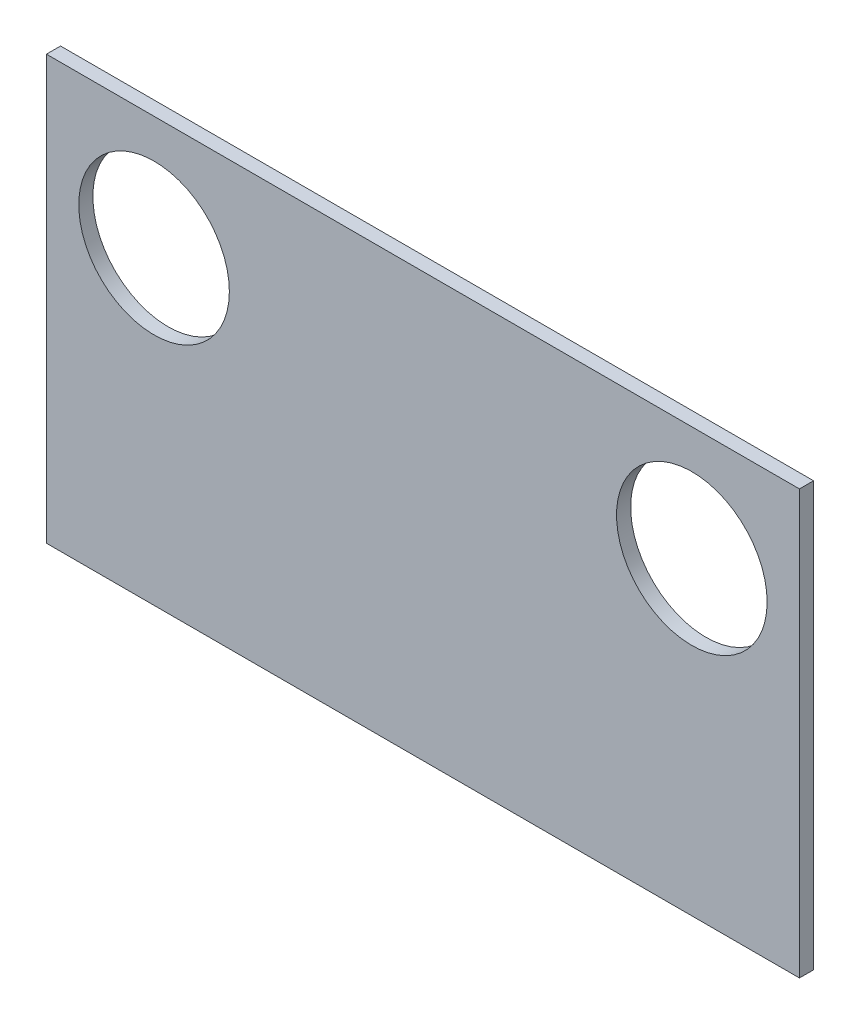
ISO-10303-21;
HEADER;
FILE_DESCRIPTION(('STEP AP214'),'2;1');
FILE_NAME('part.step','',(''),(''),'','','');
FILE_SCHEMA(('AUTOMOTIVE_DESIGN { 1 0 10303 214 1 1 1 1 }'));
ENDSEC;
DATA;
#1=APPLICATION_CONTEXT('core data for automotive mechanical design processes');
#2=APPLICATION_PROTOCOL_DEFINITION('international standard','automotive_design',2000,#1);
#3=PRODUCT_CONTEXT('',#1,'mechanical');
#4=PRODUCT('Part','Part','',(#3));
#5=PRODUCT_RELATED_PRODUCT_CATEGORY('part','',(#4));
#6=PRODUCT_DEFINITION_FORMATION('','',#4);
#7=PRODUCT_DEFINITION_CONTEXT('part definition',#1,'design');
#8=PRODUCT_DEFINITION('design','',#6,#7);
#9=PRODUCT_DEFINITION_SHAPE('','',#8);
#10=(LENGTH_UNIT() NAMED_UNIT(*) SI_UNIT(.MILLI.,.METRE.));
#11=(NAMED_UNIT(*) PLANE_ANGLE_UNIT() SI_UNIT($,.RADIAN.));
#12=(NAMED_UNIT(*) SI_UNIT($,.STERADIAN.) SOLID_ANGLE_UNIT());
#13=UNCERTAINTY_MEASURE_WITH_UNIT(LENGTH_MEASURE(1.E-05),#10,'distance_accuracy_value','');
#14=(GEOMETRIC_REPRESENTATION_CONTEXT(3) GLOBAL_UNCERTAINTY_ASSIGNED_CONTEXT((#13)) GLOBAL_UNIT_ASSIGNED_CONTEXT((#10,
#11,#12)) REPRESENTATION_CONTEXT('',''));
#15=CARTESIAN_POINT('',(0.,0.,0.));
#16=DIRECTION('',(0.,0.,1.));
#17=DIRECTION('',(1.,0.,0.));
#18=AXIS2_PLACEMENT_3D('',#15,#16,#17);
#19=CARTESIAN_POINT('',(0.,0.,0.95));
#20=DIRECTION('',(0.,0.,1.));
#21=DIRECTION('',(1.,0.,0.));
#22=AXIS2_PLACEMENT_3D('',#19,#20,#21);
#23=PLANE('',#22);
#24=CARTESIAN_POINT('',(-5.71341019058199,18.1206220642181,0.95));
#25=DIRECTION('',(0.,0.,1.));
#26=DIRECTION('',(1.,0.,0.));
#27=AXIS2_PLACEMENT_3D('',#24,#25,#26);
#28=CIRCLE('',#27,1.6);
#29=CARTESIAN_POINT('',(-4.11341019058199,18.1206220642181,0.95));
#30=VERTEX_POINT('',#29);
#31=EDGE_CURVE('E102',#30,#30,#28,.T.);
#32=ORIENTED_EDGE('',*,*,#31,.F.);
#33=EDGE_LOOP('',(#32));
#34=FACE_BOUND('',#33,.T.);
#35=DIRECTION('',(0.,-1.,0.));
#36=VECTOR('',#35,1.);
#37=CARTESIAN_POINT('',(-8.,20.5449940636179,0.95));
#38=LINE('',#37,#36);
#39=CARTESIAN_POINT('',(-8.,20.5449940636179,0.95));
#40=VERTEX_POINT('',#39);
#41=CARTESIAN_POINT('',(-8.,11.544994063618,0.95));
#42=VERTEX_POINT('',#41);
#43=EDGE_CURVE('E87',#40,#42,#38,.T.);
#44=ORIENTED_EDGE('',*,*,#43,.T.);
#45=DIRECTION('',(1.,0.,0.));
#46=VECTOR('',#45,1.);
#47=CARTESIAN_POINT('',(-8.,11.544994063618,0.95));
#48=LINE('',#47,#46);
#49=CARTESIAN_POINT('',(8.,11.544994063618,0.95));
#50=VERTEX_POINT('',#49);
#51=EDGE_CURVE('E82',#42,#50,#48,.T.);
#52=ORIENTED_EDGE('',*,*,#51,.T.);
#53=DIRECTION('',(0.,1.,0.));
#54=VECTOR('',#53,1.);
#55=CARTESIAN_POINT('',(8.,20.5449940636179,0.95));
#56=LINE('',#55,#54);
#57=CARTESIAN_POINT('',(8.,20.5449940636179,0.95));
#58=VERTEX_POINT('',#57);
#59=EDGE_CURVE('E85',#50,#58,#56,.T.);
#60=ORIENTED_EDGE('',*,*,#59,.T.);
#61=DIRECTION('',(-1.,0.,0.));
#62=VECTOR('',#61,1.);
#63=CARTESIAN_POINT('',(-8.,20.5449940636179,0.95));
#64=LINE('',#63,#62);
#65=EDGE_CURVE('E52',#58,#40,#64,.T.);
#66=ORIENTED_EDGE('',*,*,#65,.T.);
#67=EDGE_LOOP('',(#44,#52,#60,#66));
#68=FACE_BOUND('',#67,.T.);
#69=CARTESIAN_POINT('',(5.7134101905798,18.1206220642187,0.95));
#70=DIRECTION('',(0.,0.,1.));
#71=DIRECTION('',(1.,0.,0.));
#72=AXIS2_PLACEMENT_3D('',#69,#70,#71);
#73=CIRCLE('',#72,1.6);
#74=CARTESIAN_POINT('',(7.3134101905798,18.1206220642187,0.95));
#75=VERTEX_POINT('',#74);
#76=EDGE_CURVE('E117',#75,#75,#73,.T.);
#77=ORIENTED_EDGE('',*,*,#76,.F.);
#78=EDGE_LOOP('',(#77));
#79=FACE_BOUND('',#78,.T.);
#80=ADVANCED_FACE('F35',(#34,#68,#79),#23,.T.);
#81=CARTESIAN_POINT('',(0.,0.,0.65));
#82=DIRECTION('',(0.,0.,1.));
#83=DIRECTION('',(1.,0.,0.));
#84=AXIS2_PLACEMENT_3D('',#81,#82,#83);
#85=PLANE('',#84);
#86=DIRECTION('',(0.,-1.,0.));
#87=VECTOR('',#86,1.);
#88=CARTESIAN_POINT('',(-8.,20.5449940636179,0.65));
#89=LINE('',#88,#87);
#90=CARTESIAN_POINT('',(-8.,20.5449940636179,0.65));
#91=VERTEX_POINT('',#90);
#92=CARTESIAN_POINT('',(-8.,11.544994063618,0.65));
#93=VERTEX_POINT('',#92);
#94=EDGE_CURVE('E99',#91,#93,#89,.T.);
#95=ORIENTED_EDGE('',*,*,#94,.F.);
#96=DIRECTION('',(-1.,0.,0.));
#97=VECTOR('',#96,1.);
#98=CARTESIAN_POINT('',(-8.,20.5449940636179,0.65));
#99=LINE('',#98,#97);
#100=CARTESIAN_POINT('',(8.,20.5449940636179,0.65));
#101=VERTEX_POINT('',#100);
#102=EDGE_CURVE('E75',#101,#91,#99,.T.);
#103=ORIENTED_EDGE('',*,*,#102,.F.);
#104=DIRECTION('',(0.,1.,0.));
#105=VECTOR('',#104,1.);
#106=CARTESIAN_POINT('',(8.,20.5449940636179,0.65));
#107=LINE('',#106,#105);
#108=CARTESIAN_POINT('',(8.,11.544994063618,0.65));
#109=VERTEX_POINT('',#108);
#110=EDGE_CURVE('E69',#109,#101,#107,.T.);
#111=ORIENTED_EDGE('',*,*,#110,.F.);
#112=DIRECTION('',(1.,0.,0.));
#113=VECTOR('',#112,1.);
#114=CARTESIAN_POINT('',(-8.,11.544994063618,0.65));
#115=LINE('',#114,#113);
#116=EDGE_CURVE('E91',#93,#109,#115,.T.);
#117=ORIENTED_EDGE('',*,*,#116,.F.);
#118=EDGE_LOOP('',(#95,#103,#111,#117));
#119=FACE_BOUND('',#118,.T.);
#120=CARTESIAN_POINT('',(-5.71341019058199,18.1206220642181,0.65));
#121=DIRECTION('',(0.,0.,1.));
#122=DIRECTION('',(1.,0.,0.));
#123=AXIS2_PLACEMENT_3D('',#120,#121,#122);
#124=CIRCLE('',#123,1.6);
#125=CARTESIAN_POINT('',(-4.11341019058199,18.1206220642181,0.65));
#126=VERTEX_POINT('',#125);
#127=EDGE_CURVE('E114',#126,#126,#124,.T.);
#128=ORIENTED_EDGE('',*,*,#127,.T.);
#129=EDGE_LOOP('',(#128));
#130=FACE_BOUND('',#129,.T.);
#131=CARTESIAN_POINT('',(5.7134101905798,18.1206220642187,0.65));
#132=DIRECTION('',(0.,0.,1.));
#133=DIRECTION('',(1.,0.,0.));
#134=AXIS2_PLACEMENT_3D('',#131,#132,#133);
#135=CIRCLE('',#134,1.6);
#136=CARTESIAN_POINT('',(7.3134101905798,18.1206220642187,0.65));
#137=VERTEX_POINT('',#136);
#138=EDGE_CURVE('E120',#137,#137,#135,.T.);
#139=ORIENTED_EDGE('',*,*,#138,.T.);
#140=EDGE_LOOP('',(#139));
#141=FACE_BOUND('',#140,.T.);
#142=ADVANCED_FACE('F110',(#119,#130,#141),#85,.F.);
#143=CARTESIAN_POINT('',(-8.,20.5449940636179,0.95));
#144=DIRECTION('',(1.,0.,0.));
#145=DIRECTION('',(0.,1.,0.));
#146=AXIS2_PLACEMENT_3D('',#143,#144,#145);
#147=PLANE('',#146);
#148=ORIENTED_EDGE('',*,*,#94,.T.);
#149=DIRECTION('',(0.,0.,-1.));
#150=VECTOR('',#149,1.);
#151=CARTESIAN_POINT('',(-8.,11.544994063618,0.95));
#152=LINE('',#151,#150);
#153=EDGE_CURVE('E11',#42,#93,#152,.T.);
#154=ORIENTED_EDGE('',*,*,#153,.F.);
#155=ORIENTED_EDGE('',*,*,#43,.F.);
#156=DIRECTION('',(0.,0.,-1.));
#157=VECTOR('',#156,1.);
#158=CARTESIAN_POINT('',(-8.,20.5449940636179,0.95));
#159=LINE('',#158,#157);
#160=EDGE_CURVE('E95',#40,#91,#159,.T.);
#161=ORIENTED_EDGE('',*,*,#160,.T.);
#162=EDGE_LOOP('',(#148,#154,#155,#161));
#163=FACE_BOUND('',#162,.T.);
#164=ADVANCED_FACE('F37',(#163),#147,.F.);
#165=CARTESIAN_POINT('',(-8.,11.544994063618,0.95));
#166=DIRECTION('',(0.,1.,0.));
#167=DIRECTION('',(0.,0.,1.));
#168=AXIS2_PLACEMENT_3D('',#165,#166,#167);
#169=PLANE('',#168);
#170=ORIENTED_EDGE('',*,*,#116,.T.);
#171=DIRECTION('',(0.,0.,-1.));
#172=VECTOR('',#171,1.);
#173=CARTESIAN_POINT('',(8.,11.544994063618,0.95));
#174=LINE('',#173,#172);
#175=EDGE_CURVE('E44',#50,#109,#174,.T.);
#176=ORIENTED_EDGE('',*,*,#175,.F.);
#177=ORIENTED_EDGE('',*,*,#51,.F.);
#178=ORIENTED_EDGE('',*,*,#153,.T.);
#179=EDGE_LOOP('',(#170,#176,#177,#178));
#180=FACE_BOUND('',#179,.T.);
#181=ADVANCED_FACE('F90',(#180),#169,.F.);
#182=CARTESIAN_POINT('',(8.,20.5449940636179,0.95));
#183=DIRECTION('',(-1.,0.,0.));
#184=DIRECTION('',(0.,0.,1.));
#185=AXIS2_PLACEMENT_3D('',#182,#183,#184);
#186=PLANE('',#185);
#187=ORIENTED_EDGE('',*,*,#110,.T.);
#188=DIRECTION('',(0.,0.,-1.));
#189=VECTOR('',#188,1.);
#190=CARTESIAN_POINT('',(8.,20.5449940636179,0.95));
#191=LINE('',#190,#189);
#192=EDGE_CURVE('E92',#58,#101,#191,.T.);
#193=ORIENTED_EDGE('',*,*,#192,.F.);
#194=ORIENTED_EDGE('',*,*,#59,.F.);
#195=ORIENTED_EDGE('',*,*,#175,.T.);
#196=EDGE_LOOP('',(#187,#193,#194,#195));
#197=FACE_BOUND('',#196,.T.);
#198=ADVANCED_FACE('F93',(#197),#186,.F.);
#199=CARTESIAN_POINT('',(-8.,20.5449940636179,0.95));
#200=DIRECTION('',(0.,-1.,0.));
#201=DIRECTION('',(0.,0.,-1.));
#202=AXIS2_PLACEMENT_3D('',#199,#200,#201);
#203=PLANE('',#202);
#204=ORIENTED_EDGE('',*,*,#102,.T.);
#205=ORIENTED_EDGE('',*,*,#160,.F.);
#206=ORIENTED_EDGE('',*,*,#65,.F.);
#207=ORIENTED_EDGE('',*,*,#192,.T.);
#208=EDGE_LOOP('',(#204,#205,#206,#207));
#209=FACE_BOUND('',#208,.T.);
#210=ADVANCED_FACE('F107',(#209),#203,.F.);
#211=CARTESIAN_POINT('',(-5.71341019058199,18.1206220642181,0.95));
#212=DIRECTION('',(0.,0.,-1.));
#213=DIRECTION('',(-1.,0.,0.));
#214=AXIS2_PLACEMENT_3D('',#211,#212,#213);
#215=CYLINDRICAL_SURFACE('',#214,1.6);
#216=ORIENTED_EDGE('',*,*,#31,.T.);
#217=EDGE_LOOP('',(#216));
#218=FACE_BOUND('',#217,.T.);
#219=ORIENTED_EDGE('',*,*,#127,.F.);
#220=EDGE_LOOP('',(#219));
#221=FACE_BOUND('',#220,.T.);
#222=ADVANCED_FACE('F137',(#218,#221),#215,.F.);
#223=CARTESIAN_POINT('',(5.7134101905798,18.1206220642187,0.95));
#224=DIRECTION('',(0.,0.,-1.));
#225=DIRECTION('',(-1.,0.,0.));
#226=AXIS2_PLACEMENT_3D('',#223,#224,#225);
#227=CYLINDRICAL_SURFACE('',#226,1.6);
#228=ORIENTED_EDGE('',*,*,#76,.T.);
#229=EDGE_LOOP('',(#228));
#230=FACE_BOUND('',#229,.T.);
#231=ORIENTED_EDGE('',*,*,#138,.F.);
#232=EDGE_LOOP('',(#231));
#233=FACE_BOUND('',#232,.T.);
#234=ADVANCED_FACE('F126',(#230,#233),#227,.F.);
#235=CLOSED_SHELL('',(#80,#142,#164,#181,#198,#210,#222,#234));
#236=MANIFOLD_SOLID_BREP('B2',#235);
#237=ADVANCED_BREP_SHAPE_REPRESENTATION('',(#18,#236),#14);
#238=SHAPE_DEFINITION_REPRESENTATION(#9,#237);
ENDSEC;
END-ISO-10303-21;
